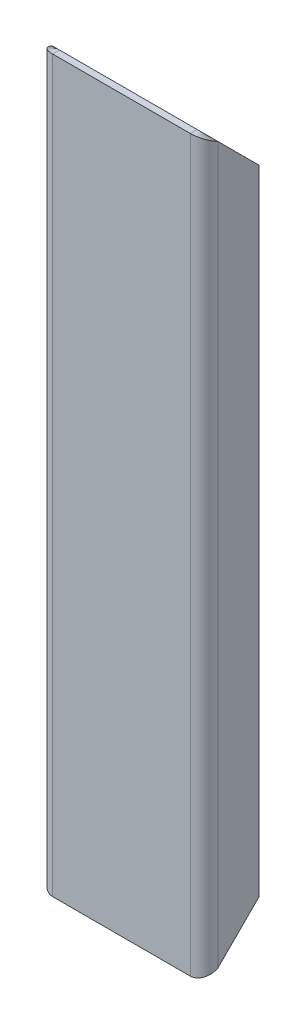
ISO-10303-21;
HEADER;
FILE_DESCRIPTION(('STEP AP214'),'2;1');
FILE_NAME('part.step','',(''),(''),'','','');
FILE_SCHEMA(('AUTOMOTIVE_DESIGN { 1 0 10303 214 1 1 1 1 }'));
ENDSEC;
DATA;
#1=APPLICATION_CONTEXT('core data for automotive mechanical design processes');
#2=APPLICATION_PROTOCOL_DEFINITION('international standard','automotive_design',2000,#1);
#3=PRODUCT_CONTEXT('',#1,'mechanical');
#4=PRODUCT('Part','Part','',(#3));
#5=PRODUCT_RELATED_PRODUCT_CATEGORY('part','',(#4));
#6=PRODUCT_DEFINITION_FORMATION('','',#4);
#7=PRODUCT_DEFINITION_CONTEXT('part definition',#1,'design');
#8=PRODUCT_DEFINITION('design','',#6,#7);
#9=PRODUCT_DEFINITION_SHAPE('','',#8);
#10=(LENGTH_UNIT() NAMED_UNIT(*) SI_UNIT(.MILLI.,.METRE.));
#11=(NAMED_UNIT(*) PLANE_ANGLE_UNIT() SI_UNIT($,.RADIAN.));
#12=(NAMED_UNIT(*) SI_UNIT($,.STERADIAN.) SOLID_ANGLE_UNIT());
#13=UNCERTAINTY_MEASURE_WITH_UNIT(LENGTH_MEASURE(1.E-05),#10,'distance_accuracy_value','');
#14=(GEOMETRIC_REPRESENTATION_CONTEXT(3) GLOBAL_UNCERTAINTY_ASSIGNED_CONTEXT((#13)) GLOBAL_UNIT_ASSIGNED_CONTEXT((#10,
#11,#12)) REPRESENTATION_CONTEXT('',''));
#15=CARTESIAN_POINT('',(0.,0.,0.));
#16=DIRECTION('',(0.,0.,1.));
#17=DIRECTION('',(1.,0.,0.));
#18=AXIS2_PLACEMENT_3D('',#15,#16,#17);
#19=CARTESIAN_POINT('',(139.700000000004,673.100000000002,-12.6999999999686));
#20=DIRECTION('',(0.,-1.,0.));
#21=DIRECTION('',(0.,0.,-1.));
#22=AXIS2_PLACEMENT_3D('',#19,#20,#21);
#23=CYLINDRICAL_SURFACE('',#22,12.7);
#24=DIRECTION('',(0.,-1.,0.));
#25=VECTOR('',#24,1.);
#26=CARTESIAN_POINT('',(152.400000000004,673.100000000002,-12.6999999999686));
#27=LINE('',#26,#25);
#28=CARTESIAN_POINT('',(152.400000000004,666.750000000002,-12.6999999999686));
#29=VERTEX_POINT('',#28);
#30=CARTESIAN_POINT('',(152.4,6.35000000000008,-12.6999999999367));
#31=VERTEX_POINT('',#30);
#32=EDGE_CURVE('E148',#29,#31,#27,.T.);
#33=ORIENTED_EDGE('',*,*,#32,.F.);
#34=CARTESIAN_POINT('',(139.700000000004,666.750000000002,-12.6999999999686));
#35=DIRECTION('',(0.,-0.894427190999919,0.447213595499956));
#36=DIRECTION('',(0.,-0.447213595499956,-0.894427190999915));
#37=AXIS2_PLACEMENT_3D('',#34,#35,#36);
#38=ELLIPSE('',#37,14.1990316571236,12.7);
#39=CARTESIAN_POINT('',(139.7,673.1,3.19744231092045E-11));
#40=VERTEX_POINT('',#39);
#41=EDGE_CURVE('E133',#40,#29,#38,.F.);
#42=ORIENTED_EDGE('',*,*,#41,.F.);
#43=DIRECTION('',(0.,-1.,0.));
#44=VECTOR('',#43,1.);
#45=CARTESIAN_POINT('',(139.7,673.1,3.19744231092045E-11));
#46=LINE('',#45,#44);
#47=CARTESIAN_POINT('',(139.7,-4.9960036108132E-13,6.3948846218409E-11));
#48=VERTEX_POINT('',#47);
#49=EDGE_CURVE('E146',#40,#48,#46,.T.);
#50=ORIENTED_EDGE('',*,*,#49,.T.);
#51=CARTESIAN_POINT('',(139.7,6.34999999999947,-12.6999999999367));
#52=DIRECTION('',(0.,0.894427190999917,0.447213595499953));
#53=DIRECTION('',(0.,-0.447213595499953,0.894427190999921));
#54=AXIS2_PLACEMENT_3D('',#51,#52,#53);
#55=ELLIPSE('',#54,14.1990316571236,12.7);
#56=EDGE_CURVE('E236',#31,#48,#55,.F.);
#57=ORIENTED_EDGE('',*,*,#56,.F.);
#58=EDGE_LOOP('',(#33,#42,#50,#57));
#59=FACE_BOUND('',#58,.T.);
#60=ADVANCED_FACE('F38',(#59),#23,.T.);
#61=CARTESIAN_POINT('',(152.4,673.1,3.19744231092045E-11));
#62=DIRECTION('',(1.,0.,0.));
#63=DIRECTION('',(0.,0.,-1.));
#64=AXIS2_PLACEMENT_3D('',#61,#62,#63);
#65=PLANE('',#64);
#66=DIRECTION('',(0.,-1.,0.));
#67=VECTOR('',#66,1.);
#68=CARTESIAN_POINT('',(152.4,673.100000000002,-50.7999999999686));
#69=LINE('',#68,#67);
#70=CARTESIAN_POINT('',(152.4,628.650000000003,-50.7999999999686));
#71=VERTEX_POINT('',#70);
#72=CARTESIAN_POINT('',(152.4,44.4499999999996,-50.7999999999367));
#73=VERTEX_POINT('',#72);
#74=EDGE_CURVE('E185',#71,#73,#69,.T.);
#75=ORIENTED_EDGE('',*,*,#74,.F.);
#76=DIRECTION('',(0.,-0.707106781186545,-0.707106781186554));
#77=VECTOR('',#76,1.);
#78=CARTESIAN_POINT('',(152.4,676.275000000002,-3.17499999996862));
#79=LINE('',#78,#77);
#80=EDGE_CURVE('E257',#29,#71,#79,.T.);
#81=ORIENTED_EDGE('',*,*,#80,.F.);
#82=ORIENTED_EDGE('',*,*,#32,.T.);
#83=DIRECTION('',(0.,0.707106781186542,-0.707106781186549));
#84=VECTOR('',#83,1.);
#85=CARTESIAN_POINT('',(152.4,0.,-6.34999999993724));
#86=LINE('',#85,#84);
#87=EDGE_CURVE('E238',#31,#73,#86,.T.);
#88=ORIENTED_EDGE('',*,*,#87,.T.);
#89=EDGE_LOOP('',(#75,#81,#82,#88));
#90=FACE_BOUND('',#89,.T.);
#91=ADVANCED_FACE('F255',(#90),#65,.T.);
#92=CARTESIAN_POINT('',(146.05,673.100000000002,-50.7999999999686));
#93=DIRECTION('',(0.,0.,-1.));
#94=DIRECTION('',(-1.,0.,0.));
#95=AXIS2_PLACEMENT_3D('',#92,#93,#94);
#96=PLANE('',#95);
#97=DIRECTION('',(0.,-1.,0.));
#98=VECTOR('',#97,1.);
#99=CARTESIAN_POINT('',(146.05,673.100000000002,-50.7999999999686));
#100=LINE('',#99,#98);
#101=CARTESIAN_POINT('',(146.05,628.650000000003,-50.7999999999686));
#102=VERTEX_POINT('',#101);
#103=CARTESIAN_POINT('',(146.05,44.449999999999,-50.7999999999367));
#104=VERTEX_POINT('',#103);
#105=EDGE_CURVE('E76',#102,#104,#100,.T.);
#106=ORIENTED_EDGE('',*,*,#105,.F.);
#107=DIRECTION('',(-1.,0.,0.));
#108=VECTOR('',#107,1.);
#109=CARTESIAN_POINT('',(146.05,628.650000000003,-50.7999999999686));
#110=LINE('',#109,#108);
#111=EDGE_CURVE('E261',#102,#71,#110,.F.);
#112=ORIENTED_EDGE('',*,*,#111,.T.);
#113=ORIENTED_EDGE('',*,*,#74,.T.);
#114=DIRECTION('',(1.,0.,0.));
#115=VECTOR('',#114,1.);
#116=CARTESIAN_POINT('',(152.4,44.4499999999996,-50.7999999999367));
#117=LINE('',#116,#115);
#118=EDGE_CURVE('E169',#73,#104,#117,.F.);
#119=ORIENTED_EDGE('',*,*,#118,.T.);
#120=EDGE_LOOP('',(#106,#112,#113,#119));
#121=FACE_BOUND('',#120,.T.);
#122=ADVANCED_FACE('F250',(#121),#96,.T.);
#123=CARTESIAN_POINT('',(146.05,673.1,3.19744231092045E-11));
#124=DIRECTION('',(1.,0.,0.));
#125=DIRECTION('',(0.,0.,-1.));
#126=AXIS2_PLACEMENT_3D('',#123,#124,#125);
#127=PLANE('',#126);
#128=DIRECTION('',(0.,-0.707106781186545,-0.707106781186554));
#129=VECTOR('',#128,1.);
#130=CARTESIAN_POINT('',(146.05,676.275000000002,-3.17499999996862));
#131=LINE('',#130,#129);
#132=CARTESIAN_POINT('',(146.050000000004,666.750000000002,-12.6999999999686));
#133=VERTEX_POINT('',#132);
#134=EDGE_CURVE('E149',#133,#102,#131,.T.);
#135=ORIENTED_EDGE('',*,*,#134,.T.);
#136=ORIENTED_EDGE('',*,*,#105,.T.);
#137=DIRECTION('',(0.,0.707106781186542,-0.707106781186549));
#138=VECTOR('',#137,1.);
#139=CARTESIAN_POINT('',(146.05,-4.9960036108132E-13,-6.34999999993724));
#140=LINE('',#139,#138);
#141=CARTESIAN_POINT('',(146.05,6.34999999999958,-12.6999999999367));
#142=VERTEX_POINT('',#141);
#143=EDGE_CURVE('E240',#142,#104,#140,.T.);
#144=ORIENTED_EDGE('',*,*,#143,.F.);
#145=DIRECTION('',(0.,-1.,0.));
#146=VECTOR('',#145,1.);
#147=CARTESIAN_POINT('',(146.050000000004,673.100000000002,-12.6999999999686));
#148=LINE('',#147,#146);
#149=EDGE_CURVE('E182',#133,#142,#148,.T.);
#150=ORIENTED_EDGE('',*,*,#149,.F.);
#151=EDGE_LOOP('',(#135,#136,#144,#150));
#152=FACE_BOUND('',#151,.T.);
#153=ADVANCED_FACE('F305',(#152),#127,.F.);
#154=CARTESIAN_POINT('',(139.700000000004,673.100000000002,-12.6999999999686));
#155=DIRECTION('',(0.,-1.,0.));
#156=DIRECTION('',(0.,0.,-1.));
#157=AXIS2_PLACEMENT_3D('',#154,#155,#156);
#158=CYLINDRICAL_SURFACE('',#157,6.35);
#159=CARTESIAN_POINT('',(139.700000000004,666.750000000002,-12.6999999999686));
#160=DIRECTION('',(0.,-0.70710678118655,0.707106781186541));
#161=DIRECTION('',(0.,-0.707106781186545,-0.707106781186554));
#162=AXIS2_PLACEMENT_3D('',#159,#160,#161);
#163=ELLIPSE('',#162,8.9802561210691,6.35);
#164=CARTESIAN_POINT('',(139.700000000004,673.100000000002,-6.34999999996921));
#165=VERTEX_POINT('',#164);
#166=EDGE_CURVE('E136',#165,#133,#163,.F.);
#167=ORIENTED_EDGE('',*,*,#166,.T.);
#168=ORIENTED_EDGE('',*,*,#149,.T.);
#169=CARTESIAN_POINT('',(139.7,6.34999999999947,-12.6999999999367));
#170=DIRECTION('',(0.,0.707106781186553,0.707106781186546));
#171=DIRECTION('',(0.,-0.707106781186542,0.707106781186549));
#172=AXIS2_PLACEMENT_3D('',#169,#170,#171);
#173=ELLIPSE('',#172,8.98025612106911,6.35);
#174=CARTESIAN_POINT('',(139.7,-4.9960036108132E-13,-6.34999999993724));
#175=VERTEX_POINT('',#174);
#176=EDGE_CURVE('E233',#142,#175,#173,.F.);
#177=ORIENTED_EDGE('',*,*,#176,.T.);
#178=DIRECTION('',(0.,-1.,0.));
#179=VECTOR('',#178,1.);
#180=CARTESIAN_POINT('',(139.700000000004,673.100000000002,-6.34999999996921));
#181=LINE('',#180,#179);
#182=EDGE_CURVE('E179',#165,#175,#181,.T.);
#183=ORIENTED_EDGE('',*,*,#182,.F.);
#184=EDGE_LOOP('',(#167,#168,#177,#183));
#185=FACE_BOUND('',#184,.T.);
#186=ADVANCED_FACE('F298',(#185),#158,.F.);
#187=CARTESIAN_POINT('',(6.35000000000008,673.1,0.));
#188=DIRECTION('',(-1.,0.,0.));
#189=DIRECTION('',(0.,0.,1.));
#190=AXIS2_PLACEMENT_3D('',#187,#188,#189);
#191=PLANE('',#190);
#192=DIRECTION('',(0.,0.707106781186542,-0.707106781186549));
#193=VECTOR('',#192,1.);
#194=CARTESIAN_POINT('',(6.35000000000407,333.375000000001,-339.725));
#195=LINE('',#194,#193);
#196=CARTESIAN_POINT('',(6.35000000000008,6.34999999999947,-12.7000000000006));
#197=VERTEX_POINT('',#196);
#198=CARTESIAN_POINT('',(6.35000000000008,44.4499999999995,-50.8000000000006));
#199=VERTEX_POINT('',#198);
#200=EDGE_CURVE('E269',#197,#199,#195,.T.);
#201=ORIENTED_EDGE('',*,*,#200,.T.);
#202=DIRECTION('',(0.,-1.,0.));
#203=VECTOR('',#202,1.);
#204=CARTESIAN_POINT('',(6.35000000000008,673.100000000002,-50.7999999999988));
#205=LINE('',#204,#203);
#206=CARTESIAN_POINT('',(6.34999999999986,628.650000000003,-50.7999999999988));
#207=VERTEX_POINT('',#206);
#208=EDGE_CURVE('E195',#207,#199,#205,.T.);
#209=ORIENTED_EDGE('',*,*,#208,.F.);
#210=DIRECTION('',(0.,0.707106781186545,0.707106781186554));
#211=VECTOR('',#210,1.);
#212=CARTESIAN_POINT('',(6.35000000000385,673.100000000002,-6.34999999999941));
#213=LINE('',#212,#211);
#214=CARTESIAN_POINT('',(6.35000000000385,666.750000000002,-12.6999999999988));
#215=VERTEX_POINT('',#214);
#216=EDGE_CURVE('E225',#207,#215,#213,.T.);
#217=ORIENTED_EDGE('',*,*,#216,.T.);
#218=DIRECTION('',(0.,-1.,0.));
#219=VECTOR('',#218,1.);
#220=CARTESIAN_POINT('',(6.35000000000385,673.100000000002,-12.6999999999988));
#221=LINE('',#220,#219);
#222=EDGE_CURVE('E164',#215,#197,#221,.T.);
#223=ORIENTED_EDGE('',*,*,#222,.T.);
#224=EDGE_LOOP('',(#201,#209,#217,#223));
#225=FACE_BOUND('',#224,.T.);
#226=ADVANCED_FACE('F296',(#225),#191,.F.);
#227=CARTESIAN_POINT('',(0.,673.100000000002,-50.7999999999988));
#228=DIRECTION('',(0.,0.,-1.));
#229=DIRECTION('',(-1.,0.,0.));
#230=AXIS2_PLACEMENT_3D('',#227,#228,#229);
#231=PLANE('',#230);
#232=ORIENTED_EDGE('',*,*,#208,.T.);
#233=DIRECTION('',(1.,0.,0.));
#234=VECTOR('',#233,1.);
#235=CARTESIAN_POINT('',(6.35000000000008,44.4499999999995,-50.8000000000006));
#236=LINE('',#235,#234);
#237=CARTESIAN_POINT('',(0.,44.4499999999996,-50.8000000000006));
#238=VERTEX_POINT('',#237);
#239=EDGE_CURVE('E216',#199,#238,#236,.F.);
#240=ORIENTED_EDGE('',*,*,#239,.T.);
#241=DIRECTION('',(0.,-1.,0.));
#242=VECTOR('',#241,1.);
#243=CARTESIAN_POINT('',(0.,673.100000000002,-50.7999999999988));
#244=LINE('',#243,#242);
#245=CARTESIAN_POINT('',(0.,628.650000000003,-50.7999999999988));
#246=VERTEX_POINT('',#245);
#247=EDGE_CURVE('E192',#246,#238,#244,.T.);
#248=ORIENTED_EDGE('',*,*,#247,.F.);
#249=DIRECTION('',(-1.,0.,0.));
#250=VECTOR('',#249,1.);
#251=CARTESIAN_POINT('',(0.,628.650000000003,-50.7999999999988));
#252=LINE('',#251,#250);
#253=EDGE_CURVE('E228',#246,#207,#252,.F.);
#254=ORIENTED_EDGE('',*,*,#253,.T.);
#255=EDGE_LOOP('',(#232,#240,#248,#254));
#256=FACE_BOUND('',#255,.T.);
#257=ADVANCED_FACE('F293',(#256),#231,.T.);
#258=CARTESIAN_POINT('',(0.,673.1,0.));
#259=DIRECTION('',(-1.,0.,0.));
#260=DIRECTION('',(0.,0.,1.));
#261=AXIS2_PLACEMENT_3D('',#258,#259,#260);
#262=PLANE('',#261);
#263=ORIENTED_EDGE('',*,*,#247,.T.);
#264=DIRECTION('',(0.,0.707106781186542,-0.707106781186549));
#265=VECTOR('',#264,1.);
#266=CARTESIAN_POINT('',(3.99680288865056E-12,333.375000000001,-339.725));
#267=LINE('',#266,#265);
#268=CARTESIAN_POINT('',(0.,6.34999999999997,-12.7000000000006));
#269=VERTEX_POINT('',#268);
#270=EDGE_CURVE('E271',#269,#238,#267,.T.);
#271=ORIENTED_EDGE('',*,*,#270,.F.);
#272=DIRECTION('',(0.,-1.,0.));
#273=VECTOR('',#272,1.);
#274=CARTESIAN_POINT('',(3.99680288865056E-12,673.100000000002,-12.6999999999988));
#275=LINE('',#274,#273);
#276=CARTESIAN_POINT('',(3.99680288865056E-12,666.750000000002,-12.6999999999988));
#277=VERTEX_POINT('',#276);
#278=EDGE_CURVE('E189',#277,#269,#275,.T.);
#279=ORIENTED_EDGE('',*,*,#278,.F.);
#280=DIRECTION('',(0.,0.707106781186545,0.707106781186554));
#281=VECTOR('',#280,1.);
#282=CARTESIAN_POINT('',(3.99680288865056E-12,673.100000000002,-6.34999999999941));
#283=LINE('',#282,#281);
#284=EDGE_CURVE('E218',#246,#277,#283,.T.);
#285=ORIENTED_EDGE('',*,*,#284,.F.);
#286=EDGE_LOOP('',(#263,#271,#279,#285));
#287=FACE_BOUND('',#286,.T.);
#288=ADVANCED_FACE('F282',(#287),#262,.T.);
#289=CARTESIAN_POINT('',(12.7000000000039,673.100000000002,-12.6999999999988));
#290=DIRECTION('',(0.,-1.,0.));
#291=DIRECTION('',(0.,0.,-1.));
#292=AXIS2_PLACEMENT_3D('',#289,#290,#291);
#293=CYLINDRICAL_SURFACE('',#292,12.7);
#294=ORIENTED_EDGE('',*,*,#278,.T.);
#295=CARTESIAN_POINT('',(12.7000000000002,6.34999999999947,-12.7000000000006));
#296=DIRECTION('',(0.,0.894427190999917,0.447213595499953));
#297=DIRECTION('',(0.,-0.447213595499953,0.894427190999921));
#298=AXIS2_PLACEMENT_3D('',#295,#296,#297);
#299=ELLIPSE('',#298,14.1990316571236,12.7);
#300=CARTESIAN_POINT('',(12.7000000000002,-4.9960036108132E-13,0.));
#301=VERTEX_POINT('',#300);
#302=EDGE_CURVE('E267',#301,#269,#299,.F.);
#303=ORIENTED_EDGE('',*,*,#302,.F.);
#304=DIRECTION('',(0.,-1.,0.));
#305=VECTOR('',#304,1.);
#306=CARTESIAN_POINT('',(12.7000000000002,673.1,0.));
#307=LINE('',#306,#305);
#308=CARTESIAN_POINT('',(12.7000000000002,673.1,0.));
#309=VERTEX_POINT('',#308);
#310=EDGE_CURVE('E158',#309,#301,#307,.T.);
#311=ORIENTED_EDGE('',*,*,#310,.F.);
#312=CARTESIAN_POINT('',(12.7000000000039,666.750000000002,-12.6999999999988));
#313=DIRECTION('',(0.,-0.894427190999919,0.447213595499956));
#314=DIRECTION('',(0.,-0.447213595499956,-0.894427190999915));
#315=AXIS2_PLACEMENT_3D('',#312,#313,#314);
#316=ELLIPSE('',#315,14.1990316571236,12.7);
#317=EDGE_CURVE('E215',#277,#309,#316,.F.);
#318=ORIENTED_EDGE('',*,*,#317,.F.);
#319=EDGE_LOOP('',(#294,#303,#311,#318));
#320=FACE_BOUND('',#319,.T.);
#321=ADVANCED_FACE('F288',(#320),#293,.T.);
#322=CARTESIAN_POINT('',(12.7000000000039,673.100000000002,-12.6999999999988));
#323=DIRECTION('',(0.,-1.,0.));
#324=DIRECTION('',(0.,0.,-1.));
#325=AXIS2_PLACEMENT_3D('',#322,#323,#324);
#326=CYLINDRICAL_SURFACE('',#325,6.35);
#327=CARTESIAN_POINT('',(12.7000000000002,6.34999999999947,-12.7000000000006));
#328=DIRECTION('',(0.,0.707106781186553,0.707106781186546));
#329=DIRECTION('',(0.,-0.707106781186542,0.707106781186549));
#330=AXIS2_PLACEMENT_3D('',#327,#328,#329);
#331=ELLIPSE('',#330,8.98025612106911,6.35);
#332=CARTESIAN_POINT('',(12.7000000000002,-4.9960036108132E-13,-6.34999999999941));
#333=VERTEX_POINT('',#332);
#334=EDGE_CURVE('E212',#333,#197,#331,.F.);
#335=ORIENTED_EDGE('',*,*,#334,.T.);
#336=ORIENTED_EDGE('',*,*,#222,.F.);
#337=CARTESIAN_POINT('',(12.7000000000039,666.750000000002,-12.6999999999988));
#338=DIRECTION('',(0.,-0.70710678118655,0.707106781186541));
#339=DIRECTION('',(0.,-0.707106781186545,-0.707106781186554));
#340=AXIS2_PLACEMENT_3D('',#337,#338,#339);
#341=ELLIPSE('',#340,8.9802561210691,6.35);
#342=CARTESIAN_POINT('',(12.7000000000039,673.100000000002,-6.34999999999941));
#343=VERTEX_POINT('',#342);
#344=EDGE_CURVE('E213',#215,#343,#341,.F.);
#345=ORIENTED_EDGE('',*,*,#344,.T.);
#346=DIRECTION('',(0.,-1.,0.));
#347=VECTOR('',#346,1.);
#348=CARTESIAN_POINT('',(12.7000000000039,673.100000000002,-6.34999999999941));
#349=LINE('',#348,#347);
#350=EDGE_CURVE('E176',#343,#333,#349,.T.);
#351=ORIENTED_EDGE('',*,*,#350,.T.);
#352=EDGE_LOOP('',(#335,#336,#345,#351));
#353=FACE_BOUND('',#352,.T.);
#354=ADVANCED_FACE('F210',(#353),#326,.F.);
#355=CARTESIAN_POINT('',(146.050000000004,673.100000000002,-12.6999999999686));
#356=DIRECTION('',(0.,1.,0.));
#357=DIRECTION('',(0.,0.,1.));
#358=AXIS2_PLACEMENT_3D('',#355,#356,#357);
#359=PLANE('',#358);
#360=DIRECTION('',(-1.,0.,0.));
#361=VECTOR('',#360,1.);
#362=CARTESIAN_POINT('',(152.4,673.1,3.19744231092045E-11));
#363=LINE('',#362,#361);
#364=EDGE_CURVE('E155',#40,#309,#363,.T.);
#365=ORIENTED_EDGE('',*,*,#364,.F.);
#366=DIRECTION('',(0.,0.,-1.));
#367=VECTOR('',#366,1.);
#368=CARTESIAN_POINT('',(139.7,673.1,3.19744231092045E-11));
#369=LINE('',#368,#367);
#370=EDGE_CURVE('E11',#40,#165,#369,.T.);
#371=ORIENTED_EDGE('',*,*,#370,.T.);
#372=DIRECTION('',(-1.,0.,0.));
#373=VECTOR('',#372,1.);
#374=CARTESIAN_POINT('',(152.400000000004,673.100000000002,-6.34999999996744));
#375=LINE('',#374,#373);
#376=EDGE_CURVE('E161',#165,#343,#375,.T.);
#377=ORIENTED_EDGE('',*,*,#376,.T.);
#378=DIRECTION('',(0.,0.,1.));
#379=VECTOR('',#378,1.);
#380=CARTESIAN_POINT('',(12.7000000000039,673.100000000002,-6.34999999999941));
#381=LINE('',#380,#379);
#382=EDGE_CURVE('E55',#343,#309,#381,.T.);
#383=ORIENTED_EDGE('',*,*,#382,.T.);
#384=EDGE_LOOP('',(#365,#371,#377,#383));
#385=FACE_BOUND('',#384,.T.);
#386=ADVANCED_FACE('F40',(#385),#359,.T.);
#387=CARTESIAN_POINT('',(6.35000000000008,-4.9960036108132E-13,-12.7000000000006));
#388=DIRECTION('',(0.,-1.,0.));
#389=DIRECTION('',(0.,0.,-1.));
#390=AXIS2_PLACEMENT_3D('',#387,#388,#389);
#391=PLANE('',#390);
#392=DIRECTION('',(-1.,0.,0.));
#393=VECTOR('',#392,1.);
#394=CARTESIAN_POINT('',(152.4,0.,6.3948846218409E-11));
#395=LINE('',#394,#393);
#396=EDGE_CURVE('E157',#48,#301,#395,.T.);
#397=ORIENTED_EDGE('',*,*,#396,.T.);
#398=DIRECTION('',(0.,0.,-1.));
#399=VECTOR('',#398,1.);
#400=CARTESIAN_POINT('',(12.7000000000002,-4.9960036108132E-13,0.));
#401=LINE('',#400,#399);
#402=EDGE_CURVE('E198',#301,#333,#401,.T.);
#403=ORIENTED_EDGE('',*,*,#402,.T.);
#404=DIRECTION('',(-1.,0.,0.));
#405=VECTOR('',#404,1.);
#406=CARTESIAN_POINT('',(152.4,0.,-6.34999999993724));
#407=LINE('',#406,#405);
#408=EDGE_CURVE('E162',#175,#333,#407,.T.);
#409=ORIENTED_EDGE('',*,*,#408,.F.);
#410=DIRECTION('',(0.,0.,1.));
#411=VECTOR('',#410,1.);
#412=CARTESIAN_POINT('',(139.7,-4.9960036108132E-13,-6.34999999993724));
#413=LINE('',#412,#411);
#414=EDGE_CURVE('E47',#175,#48,#413,.T.);
#415=ORIENTED_EDGE('',*,*,#414,.T.);
#416=EDGE_LOOP('',(#397,#403,#409,#415));
#417=FACE_BOUND('',#416,.T.);
#418=ADVANCED_FACE('F203',(#417),#391,.T.);
#419=CARTESIAN_POINT('',(152.4,673.1,3.19744231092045E-11));
#420=DIRECTION('',(0.,0.,1.));
#421=DIRECTION('',(1.,0.,0.));
#422=AXIS2_PLACEMENT_3D('',#419,#420,#421);
#423=PLANE('',#422);
#424=ORIENTED_EDGE('',*,*,#396,.F.);
#425=ORIENTED_EDGE('',*,*,#49,.F.);
#426=ORIENTED_EDGE('',*,*,#364,.T.);
#427=ORIENTED_EDGE('',*,*,#310,.T.);
#428=EDGE_LOOP('',(#424,#425,#426,#427));
#429=FACE_BOUND('',#428,.T.);
#430=ADVANCED_FACE('F153',(#429),#423,.T.);
#431=CARTESIAN_POINT('',(152.400000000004,673.100000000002,-6.34999999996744));
#432=DIRECTION('',(0.,0.,1.));
#433=DIRECTION('',(1.,0.,0.));
#434=AXIS2_PLACEMENT_3D('',#431,#432,#433);
#435=PLANE('',#434);
#436=ORIENTED_EDGE('',*,*,#408,.T.);
#437=ORIENTED_EDGE('',*,*,#350,.F.);
#438=ORIENTED_EDGE('',*,*,#376,.F.);
#439=ORIENTED_EDGE('',*,*,#182,.T.);
#440=EDGE_LOOP('',(#436,#437,#438,#439));
#441=FACE_BOUND('',#440,.T.);
#442=ADVANCED_FACE('F206',(#441),#435,.F.);
#443=CARTESIAN_POINT('',(152.4,0.,-6.34999999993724));
#444=DIRECTION('',(0.,-0.707106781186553,-0.707106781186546));
#445=DIRECTION('',(0.,0.707106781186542,-0.707106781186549));
#446=AXIS2_PLACEMENT_3D('',#443,#444,#445);
#447=PLANE('',#446);
#448=ORIENTED_EDGE('',*,*,#87,.F.);
#449=DIRECTION('',(1.,0.,0.));
#450=VECTOR('',#449,1.);
#451=CARTESIAN_POINT('',(152.4,6.35000000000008,-12.6999999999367));
#452=LINE('',#451,#450);
#453=EDGE_CURVE('E172',#31,#142,#452,.F.);
#454=ORIENTED_EDGE('',*,*,#453,.T.);
#455=ORIENTED_EDGE('',*,*,#143,.T.);
#456=ORIENTED_EDGE('',*,*,#118,.F.);
#457=EDGE_LOOP('',(#448,#454,#455,#456));
#458=FACE_BOUND('',#457,.T.);
#459=ADVANCED_FACE('F253',(#458),#447,.T.);
#460=CARTESIAN_POINT('',(139.7,-4.16333634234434E-13,6.3948846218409E-11));
#461=CARTESIAN_POINT('',(139.7,-4.44089209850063E-13,-2.11666666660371));
#462=CARTESIAN_POINT('',(139.7,-4.71844785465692E-13,-4.23333333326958));
#463=CARTESIAN_POINT('',(139.7,-4.71844785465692E-13,-6.34999999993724));
#464=CARTESIAN_POINT('',(114.3,-3.12250225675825E-13,3.86357612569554E-11));
#465=CARTESIAN_POINT('',(118.533333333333,-3.33066907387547E-13,-2.11666666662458));
#466=CARTESIAN_POINT('',(122.766666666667,-3.33066907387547E-13,-4.23333333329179));
#467=CARTESIAN_POINT('',(126.999999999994,-3.53883589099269E-13,-6.34999999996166));
#468=CARTESIAN_POINT('',(114.3,12.6999999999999,-25.3999999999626));
#469=CARTESIAN_POINT('',(118.533333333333,12.6999999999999,-23.2833333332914));
#470=CARTESIAN_POINT('',(122.766666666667,12.6999999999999,-21.1666666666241));
#471=CARTESIAN_POINT('',(126.999999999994,12.6999999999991,-19.0499999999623));
#472=CARTESIAN_POINT('',(139.7,12.6999999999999,-25.3999999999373));
#473=CARTESIAN_POINT('',(139.7,12.6999999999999,-23.2833333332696));
#474=CARTESIAN_POINT('',(139.7,12.6999999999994,-21.1666666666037));
#475=CARTESIAN_POINT('',(139.7,12.6999999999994,-19.0499999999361));
#476=CARTESIAN_POINT('',(165.1,12.6999999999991,-25.3999999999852));
#477=CARTESIAN_POINT('',(160.866666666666,12.6999999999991,-23.2833333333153));
#478=CARTESIAN_POINT('',(156.633333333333,12.6999999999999,-21.1666666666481));
#479=CARTESIAN_POINT('',(152.399999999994,12.6999999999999,-19.0499999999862));
#480=CARTESIAN_POINT('',(165.1,-3.12250225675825E-13,1.46549439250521E-11));
#481=CARTESIAN_POINT('',(160.866666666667,-3.33066907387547E-13,-2.11666666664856));
#482=CARTESIAN_POINT('',(156.633333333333,-3.33066907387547E-13,-4.23333333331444));
#483=CARTESIAN_POINT('',(152.399999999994,-7.07767178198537E-13,-6.34999999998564));
#484=CARTESIAN_POINT('',(139.7,-4.16333634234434E-13,6.3948846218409E-11));
#485=CARTESIAN_POINT('',(139.7,-4.44089209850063E-13,-2.11666666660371));
#486=CARTESIAN_POINT('',(139.7,-4.71844785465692E-13,-4.23333333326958));
#487=CARTESIAN_POINT('',(139.7,-4.71844785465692E-13,-6.34999999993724));
#488=(BOUNDED_SURFACE() B_SPLINE_SURFACE(3,3,((#460,#461,#462,#463),(#464,#465,#466,#467),(#468,
#469,#470,#471),(#472,#473,#474,#475),(#476,#477,#478,#479),(#480,#481,#482,#483),(#484,#485,
#486,#487)),.UNSPECIFIED.,.T.,.F.,.F.) B_SPLINE_SURFACE_WITH_KNOTS((4,3,4),(4,4),(0.,0.5,1.),
(0.,1.),.UNSPECIFIED.) GEOMETRIC_REPRESENTATION_ITEM() RATIONAL_B_SPLINE_SURFACE(((1.,1.,1.,1.),
(0.333333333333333,0.333333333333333,0.333333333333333,0.333333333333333),(0.333333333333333,
0.333333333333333,0.333333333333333,0.333333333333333),(1.,1.,1.,1.),(0.333333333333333,
0.333333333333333,0.333333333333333,0.333333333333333),(0.333333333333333,0.333333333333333,
0.333333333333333,0.333333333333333),(1.,1.,1.,1.))) REPRESENTATION_ITEM('') SURFACE());
#489=ORIENTED_EDGE('',*,*,#414,.F.);
#490=ORIENTED_EDGE('',*,*,#176,.F.);
#491=ORIENTED_EDGE('',*,*,#453,.F.);
#492=ORIENTED_EDGE('',*,*,#56,.T.);
#493=EDGE_LOOP('',(#489,#490,#491,#492));
#494=FACE_BOUND('',#493,.T.);
#495=ADVANCED_FACE('F361',(#494),#488,.T.);
#496=CARTESIAN_POINT('',(3.99680288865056E-12,673.100000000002,-6.34999999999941));
#497=DIRECTION('',(0.,-0.70710678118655,0.707106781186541));
#498=DIRECTION('',(0.,0.707106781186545,0.707106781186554));
#499=AXIS2_PLACEMENT_3D('',#496,#497,#498);
#500=PLANE('',#499);
#501=ORIENTED_EDGE('',*,*,#284,.T.);
#502=DIRECTION('',(-1.,0.,0.));
#503=VECTOR('',#502,1.);
#504=CARTESIAN_POINT('',(3.99680288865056E-12,666.750000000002,-12.6999999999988));
#505=LINE('',#504,#503);
#506=EDGE_CURVE('E231',#277,#215,#505,.F.);
#507=ORIENTED_EDGE('',*,*,#506,.T.);
#508=ORIENTED_EDGE('',*,*,#216,.F.);
#509=ORIENTED_EDGE('',*,*,#253,.F.);
#510=EDGE_LOOP('',(#501,#507,#508,#509));
#511=FACE_BOUND('',#510,.T.);
#512=ADVANCED_FACE('F291',(#511),#500,.F.);
#513=CARTESIAN_POINT('',(12.6999999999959,660.400000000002,-25.3999999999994));
#514=CARTESIAN_POINT('',(12.6999999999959,660.400000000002,-23.2833333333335));
#515=CARTESIAN_POINT('',(12.6999999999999,660.400000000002,-21.1666666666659));
#516=CARTESIAN_POINT('',(12.6999999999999,660.400000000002,-19.05));
#517=CARTESIAN_POINT('',(-12.6999999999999,660.4,-25.3999999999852));
#518=CARTESIAN_POINT('',(-8.46666666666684,660.4,-23.283333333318));
#519=CARTESIAN_POINT('',(-4.23333333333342,660.4,-21.1666666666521));
#520=CARTESIAN_POINT('',(0.,660.4,-19.0499999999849));
#521=CARTESIAN_POINT('',(-12.6999999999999,673.1,1.46549439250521E-11));
#522=CARTESIAN_POINT('',(-8.46666666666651,673.1,-2.11666666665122));
#523=CARTESIAN_POINT('',(-4.23333333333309,673.1,-4.23333333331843));
#524=CARTESIAN_POINT('',(-5.99520433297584E-12,673.1,-6.34999999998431));
#525=CARTESIAN_POINT('',(12.7000000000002,673.1,0.));
#526=CARTESIAN_POINT('',(12.7000000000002,673.100000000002,-2.11666666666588));
#527=CARTESIAN_POINT('',(12.7000000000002,673.100000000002,-4.23333333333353));
#528=CARTESIAN_POINT('',(12.7000000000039,673.100000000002,-6.34999999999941));
#529=CARTESIAN_POINT('',(38.1000000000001,673.100000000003,3.86357612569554E-11));
#530=CARTESIAN_POINT('',(33.8666666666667,673.1,-2.11666666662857));
#531=CARTESIAN_POINT('',(29.6333333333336,673.1,-4.23333333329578));
#532=CARTESIAN_POINT('',(25.3999999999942,673.1,-6.34999999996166));
#533=CARTESIAN_POINT('',(38.0999999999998,660.400000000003,-25.3999999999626));
#534=CARTESIAN_POINT('',(33.8666666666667,660.4,-23.2833333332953));
#535=CARTESIAN_POINT('',(29.6333333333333,660.4,-21.1666666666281));
#536=CARTESIAN_POINT('',(25.3999999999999,660.4,-19.0499999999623));
#537=CARTESIAN_POINT('',(12.6999999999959,660.400000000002,-25.3999999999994));
#538=CARTESIAN_POINT('',(12.6999999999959,660.400000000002,-23.2833333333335));
#539=CARTESIAN_POINT('',(12.6999999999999,660.400000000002,-21.1666666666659));
#540=CARTESIAN_POINT('',(12.6999999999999,660.400000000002,-19.05));
#541=(BOUNDED_SURFACE() B_SPLINE_SURFACE(3,3,((#513,#514,#515,#516),(#517,#518,#519,#520),(#521,
#522,#523,#524),(#525,#526,#527,#528),(#529,#530,#531,#532),(#533,#534,#535,#536),(#537,#538,
#539,#540)),.UNSPECIFIED.,.T.,.F.,.F.) B_SPLINE_SURFACE_WITH_KNOTS((4,3,4),(4,4),(0.,0.5,1.),
(0.,1.),.UNSPECIFIED.) GEOMETRIC_REPRESENTATION_ITEM() RATIONAL_B_SPLINE_SURFACE(((1.,1.,1.,1.),
(0.333333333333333,0.333333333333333,0.333333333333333,0.333333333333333),(0.333333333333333,
0.333333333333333,0.333333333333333,0.333333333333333),(1.,1.,1.,1.),(0.333333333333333,
0.333333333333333,0.333333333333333,0.333333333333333),(0.333333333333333,0.333333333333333,
0.333333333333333,0.333333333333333),(1.,1.,1.,1.))) REPRESENTATION_ITEM('') SURFACE());
#542=ORIENTED_EDGE('',*,*,#382,.F.);
#543=ORIENTED_EDGE('',*,*,#344,.F.);
#544=ORIENTED_EDGE('',*,*,#506,.F.);
#545=ORIENTED_EDGE('',*,*,#317,.T.);
#546=EDGE_LOOP('',(#542,#543,#544,#545));
#547=FACE_BOUND('',#546,.T.);
#548=ADVANCED_FACE('F289',(#547),#541,.T.);
#549=CARTESIAN_POINT('',(6.35000000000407,333.375000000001,-339.725));
#550=DIRECTION('',(0.,0.707106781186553,0.707106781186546));
#551=DIRECTION('',(0.,0.707106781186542,-0.707106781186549));
#552=AXIS2_PLACEMENT_3D('',#549,#550,#551);
#553=PLANE('',#552);
#554=ORIENTED_EDGE('',*,*,#239,.F.);
#555=ORIENTED_EDGE('',*,*,#200,.F.);
#556=DIRECTION('',(1.,0.,0.));
#557=VECTOR('',#556,1.);
#558=CARTESIAN_POINT('',(6.35000000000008,6.34999999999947,-12.7000000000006));
#559=LINE('',#558,#557);
#560=EDGE_CURVE('E221',#197,#269,#559,.F.);
#561=ORIENTED_EDGE('',*,*,#560,.T.);
#562=ORIENTED_EDGE('',*,*,#270,.T.);
#563=EDGE_LOOP('',(#554,#555,#561,#562));
#564=FACE_BOUND('',#563,.T.);
#565=ADVANCED_FACE('F278',(#564),#553,.F.);
#566=CARTESIAN_POINT('',(12.6999999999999,-4.16333634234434E-13,0.));
#567=CARTESIAN_POINT('',(12.6999999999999,-4.71844785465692E-13,-2.11666666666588));
#568=CARTESIAN_POINT('',(12.7000000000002,-4.71844785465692E-13,-4.23333333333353));
#569=CARTESIAN_POINT('',(12.7000000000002,-4.71844785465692E-13,-6.34999999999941));
#570=CARTESIAN_POINT('',(-12.6999999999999,-3.12250225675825E-13,-9.32587340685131E-12));
#571=CARTESIAN_POINT('',(-8.46666666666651,-3.33066907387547E-13,-2.11666666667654));
#572=CARTESIAN_POINT('',(-4.23333333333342,-3.33066907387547E-13,-4.23333333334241));
#573=CARTESIAN_POINT('',(-5.99520433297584E-12,-7.07767178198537E-13,-6.35000000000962));
#574=CARTESIAN_POINT('',(-12.7000000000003,12.6999999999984,-25.3999999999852));
#575=CARTESIAN_POINT('',(-8.46666666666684,12.6999999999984,-23.2833333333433));
#576=CARTESIAN_POINT('',(-4.23333333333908,12.6999999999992,-21.1666666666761));
#577=CARTESIAN_POINT('',(-5.99520433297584E-12,12.6999999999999,-19.0500000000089));
#578=CARTESIAN_POINT('',(12.6999999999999,12.6999999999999,-25.3999999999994));
#579=CARTESIAN_POINT('',(12.6999999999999,12.6999999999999,-23.2833333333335));
#580=CARTESIAN_POINT('',(12.7000000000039,12.6999999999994,-21.1666666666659));
#581=CARTESIAN_POINT('',(12.7000000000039,12.6999999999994,-19.05));
#582=CARTESIAN_POINT('',(38.0999999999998,12.6999999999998,-25.4000000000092));
#583=CARTESIAN_POINT('',(33.8666666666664,12.6999999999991,-23.283333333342));
#584=CARTESIAN_POINT('',(29.6333333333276,12.6999999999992,-21.1666666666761));
#585=CARTESIAN_POINT('',(25.3999999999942,12.6999999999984,-19.0500000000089));
#586=CARTESIAN_POINT('',(38.1000000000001,-3.12250225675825E-13,-9.32587340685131E-12));
#587=CARTESIAN_POINT('',(33.8666666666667,-3.12250225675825E-13,-2.1166666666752));
#588=CARTESIAN_POINT('',(29.6333333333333,-3.33066907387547E-13,-4.23333333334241));
#589=CARTESIAN_POINT('',(25.3999999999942,-7.28583859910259E-13,-6.35000000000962));
#590=CARTESIAN_POINT('',(12.6999999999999,-4.16333634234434E-13,0.));
#591=CARTESIAN_POINT('',(12.6999999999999,-4.71844785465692E-13,-2.11666666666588));
#592=CARTESIAN_POINT('',(12.7000000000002,-4.71844785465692E-13,-4.23333333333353));
#593=CARTESIAN_POINT('',(12.7000000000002,-4.71844785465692E-13,-6.34999999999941));
#594=(BOUNDED_SURFACE() B_SPLINE_SURFACE(3,3,((#566,#567,#568,#569),(#570,#571,#572,#573),(#574,
#575,#576,#577),(#578,#579,#580,#581),(#582,#583,#584,#585),(#586,#587,#588,#589),(#590,#591,
#592,#593)),.UNSPECIFIED.,.T.,.F.,.F.) B_SPLINE_SURFACE_WITH_KNOTS((4,3,4),(4,4),(0.,0.5,1.),
(0.,1.),.UNSPECIFIED.) GEOMETRIC_REPRESENTATION_ITEM() RATIONAL_B_SPLINE_SURFACE(((1.,1.,1.,1.),
(0.333333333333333,0.333333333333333,0.333333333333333,0.333333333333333),(0.333333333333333,
0.333333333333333,0.333333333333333,0.333333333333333),(1.,1.,1.,1.),(0.333333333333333,
0.333333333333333,0.333333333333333,0.333333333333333),(0.333333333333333,0.333333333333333,
0.333333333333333,0.333333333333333),(1.,1.,1.,1.))) REPRESENTATION_ITEM('') SURFACE());
#595=ORIENTED_EDGE('',*,*,#560,.F.);
#596=ORIENTED_EDGE('',*,*,#334,.F.);
#597=ORIENTED_EDGE('',*,*,#402,.F.);
#598=ORIENTED_EDGE('',*,*,#302,.T.);
#599=EDGE_LOOP('',(#595,#596,#597,#598));
#600=FACE_BOUND('',#599,.T.);
#601=ADVANCED_FACE('F386',(#600),#594,.T.);
#602=CARTESIAN_POINT('',(146.05,676.275000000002,-3.17499999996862));
#603=DIRECTION('',(0.,-0.70710678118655,0.707106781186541));
#604=DIRECTION('',(0.,-0.707106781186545,-0.707106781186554));
#605=AXIS2_PLACEMENT_3D('',#602,#603,#604);
#606=PLANE('',#605);
#607=ORIENTED_EDGE('',*,*,#111,.F.);
#608=ORIENTED_EDGE('',*,*,#134,.F.);
#609=DIRECTION('',(-1.,0.,0.));
#610=VECTOR('',#609,1.);
#611=CARTESIAN_POINT('',(146.050000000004,666.750000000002,-12.6999999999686));
#612=LINE('',#611,#610);
#613=EDGE_CURVE('E259',#133,#29,#612,.F.);
#614=ORIENTED_EDGE('',*,*,#613,.T.);
#615=ORIENTED_EDGE('',*,*,#80,.T.);
#616=EDGE_LOOP('',(#607,#608,#614,#615));
#617=FACE_BOUND('',#616,.T.);
#618=ADVANCED_FACE('F393',(#617),#606,.F.);
#619=CARTESIAN_POINT('',(139.7,660.400000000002,-25.3999999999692));
#620=CARTESIAN_POINT('',(139.7,660.400000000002,-23.2833333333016));
#621=CARTESIAN_POINT('',(139.7,660.400000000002,-21.1666666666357));
#622=CARTESIAN_POINT('',(139.7,660.400000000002,-19.049999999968));
#623=CARTESIAN_POINT('',(114.3,660.4,-25.4000000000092));
#624=CARTESIAN_POINT('',(118.533333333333,660.4,-23.2833333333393));
#625=CARTESIAN_POINT('',(122.766666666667,660.4,-21.1666666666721));
#626=CARTESIAN_POINT('',(127.,660.4,-19.0500000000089));
#627=CARTESIAN_POINT('',(114.3,673.1,-9.32587340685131E-12));
#628=CARTESIAN_POINT('',(118.533333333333,673.1,-2.11666666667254));
#629=CARTESIAN_POINT('',(122.766666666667,673.1,-4.23333333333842));
#630=CARTESIAN_POINT('',(126.999999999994,673.1,-6.35000000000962));
#631=CARTESIAN_POINT('',(139.7,673.1,3.19744231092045E-11));
#632=CARTESIAN_POINT('',(139.7,673.100000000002,-2.11666666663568));
#633=CARTESIAN_POINT('',(139.7,673.100000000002,-4.23333333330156));
#634=CARTESIAN_POINT('',(139.700000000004,673.100000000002,-6.34999999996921));
#635=CARTESIAN_POINT('',(165.1,673.1,-9.32587340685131E-12));
#636=CARTESIAN_POINT('',(160.866666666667,673.1,-2.11666666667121));
#637=CARTESIAN_POINT('',(156.633333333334,673.099999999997,-4.23333333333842));
#638=CARTESIAN_POINT('',(152.399999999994,673.1,-6.35000000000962));
#639=CARTESIAN_POINT('',(165.1,660.4,-25.4000000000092));
#640=CARTESIAN_POINT('',(160.866666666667,660.4,-23.283333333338));
#641=CARTESIAN_POINT('',(156.633333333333,660.399999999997,-21.1666666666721));
#642=CARTESIAN_POINT('',(152.4,660.4,-19.0500000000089));
#643=CARTESIAN_POINT('',(139.7,660.400000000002,-25.3999999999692));
#644=CARTESIAN_POINT('',(139.7,660.400000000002,-23.2833333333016));
#645=CARTESIAN_POINT('',(139.7,660.400000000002,-21.1666666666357));
#646=CARTESIAN_POINT('',(139.7,660.400000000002,-19.049999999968));
#647=(BOUNDED_SURFACE() B_SPLINE_SURFACE(3,3,((#619,#620,#621,#622),(#623,#624,#625,#626),(#627,
#628,#629,#630),(#631,#632,#633,#634),(#635,#636,#637,#638),(#639,#640,#641,#642),(#643,#644,
#645,#646)),.UNSPECIFIED.,.T.,.F.,.F.) B_SPLINE_SURFACE_WITH_KNOTS((4,3,4),(4,4),(0.,0.5,1.),
(0.,1.),.UNSPECIFIED.) GEOMETRIC_REPRESENTATION_ITEM() RATIONAL_B_SPLINE_SURFACE(((1.,1.,1.,1.),
(0.333333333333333,0.333333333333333,0.333333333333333,0.333333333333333),(0.333333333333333,
0.333333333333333,0.333333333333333,0.333333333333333),(1.,1.,1.,1.),(0.333333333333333,
0.333333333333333,0.333333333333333,0.333333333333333),(0.333333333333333,0.333333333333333,
0.333333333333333,0.333333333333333),(1.,1.,1.,1.))) REPRESENTATION_ITEM('') SURFACE());
#648=ORIENTED_EDGE('',*,*,#613,.F.);
#649=ORIENTED_EDGE('',*,*,#166,.F.);
#650=ORIENTED_EDGE('',*,*,#370,.F.);
#651=ORIENTED_EDGE('',*,*,#41,.T.);
#652=EDGE_LOOP('',(#648,#649,#650,#651));
#653=FACE_BOUND('',#652,.T.);
#654=ADVANCED_FACE('F132',(#653),#647,.T.);
#655=CLOSED_SHELL('',(#60,#91,#122,#153,#186,#226,#257,#288,#321,#354,#386,#418,#430,#442,#459,
#495,#512,#548,#565,#601,#618,#654));
#656=MANIFOLD_SOLID_BREP('B2',#655);
#657=ADVANCED_BREP_SHAPE_REPRESENTATION('',(#18,#656),#14);
#658=SHAPE_DEFINITION_REPRESENTATION(#9,#657);
ENDSEC;
END-ISO-10303-21;
